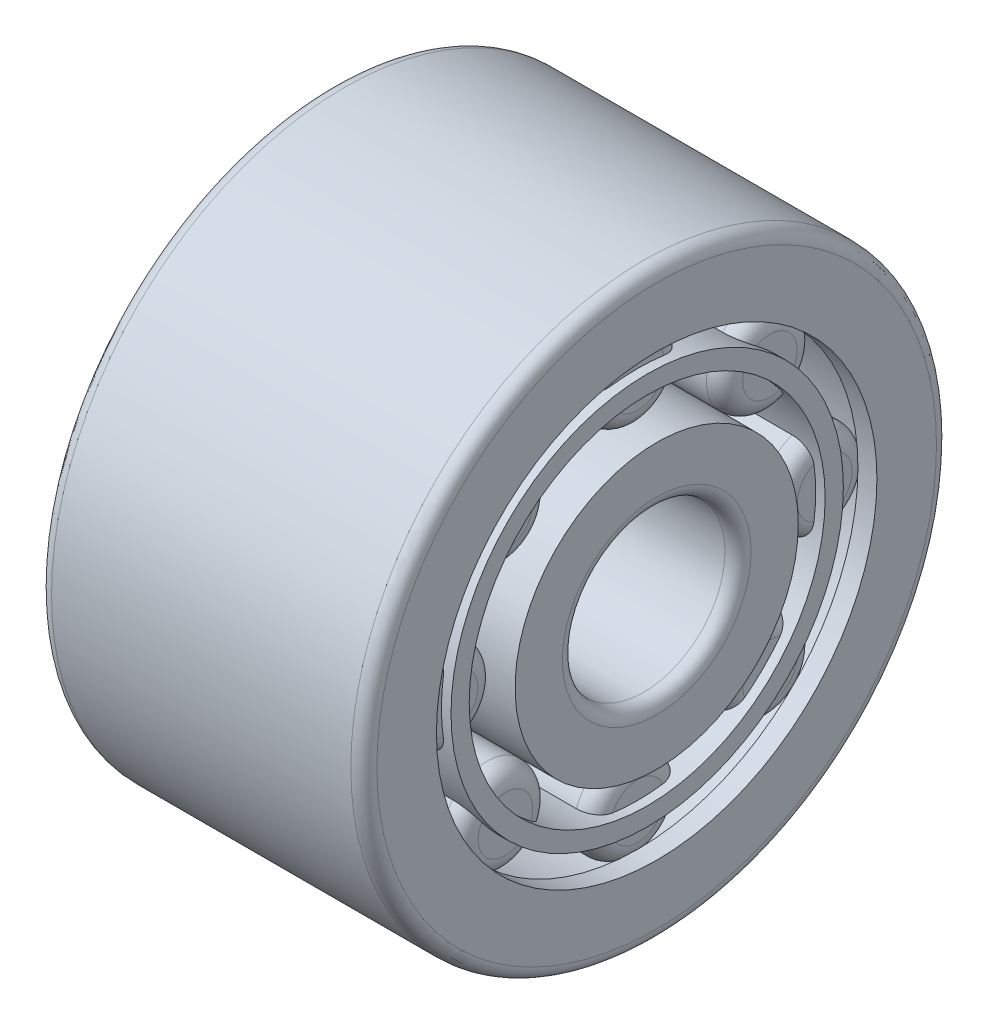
from build123d import *

# Parameters (mm, degrees)
CAGSPISKE_W           = 29.897916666
CAGSPISKE_H           = 1.775025
ROLLERSDETAILED_COUNT = 8
ROLLERSDETAILED_ANGLE = 315


with BuildPart() as part:
    # OutRacSke → OuterRace (revolve)
    with BuildSketch(Plane.XY, mode=Mode.PRIVATE) as outerrace_sk:
        with BuildLine():
            Line((-14.022916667, 22.6933125), (-14.022916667, 21.4933125))
            Line((-14.022916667, 21.4933125), (-15.875, 21.4933125))
            Line((-15.875, 21.4933125), (-15.875, 27.305))
            ThreePointArc((-15.875, 27.305), (-15.503025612, 28.203025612), (-14.605, 28.575))
            Line((-14.605, 28.575), (14.605, 28.575))
            ThreePointArc((14.605, 28.575), (15.503025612, 28.203025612), (15.875, 27.305))
            Line((15.875, 27.305), (15.875, 21.4933125))
            Line((15.875, 21.4933125), (14.022916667, 21.4933125))
            Line((14.022916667, 21.4933125), (14.022916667, 22.6933125))
            Line((14.022916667, 22.6933125), (-14.022916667, 22.6933125))
        make_face()
    revolve(outerrace_sk.sketch.rotate(Axis((-7.9375, 0, 0), (1, 0, 0)), 270), axis=Axis((-7.9375, 0, 0), (1, 0, 0)))

    # RolDetSke → RollerDetailed (revolve)
    with BuildSketch(Plane.XY, mode=Mode.PRIVATE) as rollerdetailed_sk:
        with BuildLine():
            Line((-14.022916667, 20.9187875), (-14.022916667, 18.25625))
            Line((-14.022916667, 18.25625), (14.022916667, 18.25625))
            Line((14.022916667, 18.25625), (14.022916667, 20.9187875))
            ThreePointArc((14.022916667, 20.9187875), (13.503023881, 22.173919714), (12.247891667, 22.6938125))
            Line((12.247891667, 22.6938125), (-12.247891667, 22.6938125))
            ThreePointArc((-12.247891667, 22.6938125), (-13.503023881, 22.173919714), (-14.022916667, 20.9187875))
        make_face()
    rollerdetailed = revolve(rollerdetailed_sk.sketch.rotate(Axis((-28.575, 18.25625, 0), (1, 0, 0)), 270), axis=Axis((-28.575, 18.25625, 0), (1, 0, 0)))

    # InsRacSke → InnerRace (revolve)
    with BuildSketch(Plane.XY, mode=Mode.PRIVATE) as innerrace_sk:
        with BuildLine():
            Line((-15.875, 13.8191875), (-15.875, 9.2075))
            ThreePointArc((-15.875, 9.2075), (-15.503025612, 8.309474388), (-14.605, 7.9375))
            Line((-14.605, 7.9375), (14.605, 7.9375))
            ThreePointArc((14.605, 7.9375), (15.503025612, 8.309474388), (15.875, 9.2075))
            Line((15.875, 9.2075), (15.875, 13.8191875))
            Line((15.875, 13.8191875), (-15.875, 13.8191875))
        make_face()
    revolve(innerrace_sk.sketch.rotate(Axis((-7.9375, 0, 0), (1, 0, 0)), 270), axis=Axis((-7.9375, 0, 0), (1, 0, 0)))

    # CagSpiSke → CageSpine (revolve)
    with BuildSketch(Plane.XY, mode=Mode.PRIVATE) as cagespine_sk:
        with Locations((0, 18.25625)):
            Rectangle(CAGSPISKE_W, CAGSPISKE_H)
    revolve(cagespine_sk.sketch.rotate(Axis((-17.159454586, 0, 0), (1, 0, 0)), 90), axis=Axis((-17.159454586, 0, 0), (1, 0, 0)))

    # RollersDetailed: RollerDetailed ×8 about axis
    rollersdetailed_axis = Axis((-50, 0, 0), (1, 0, 0))
    for i in range(1, ROLLERSDETAILED_COUNT):
        add(rollerdetailed.rotate(rollersdetailed_axis, i * ROLLERSDETAILED_ANGLE / (ROLLERSDETAILED_COUNT - 1)))


solid = part.part
